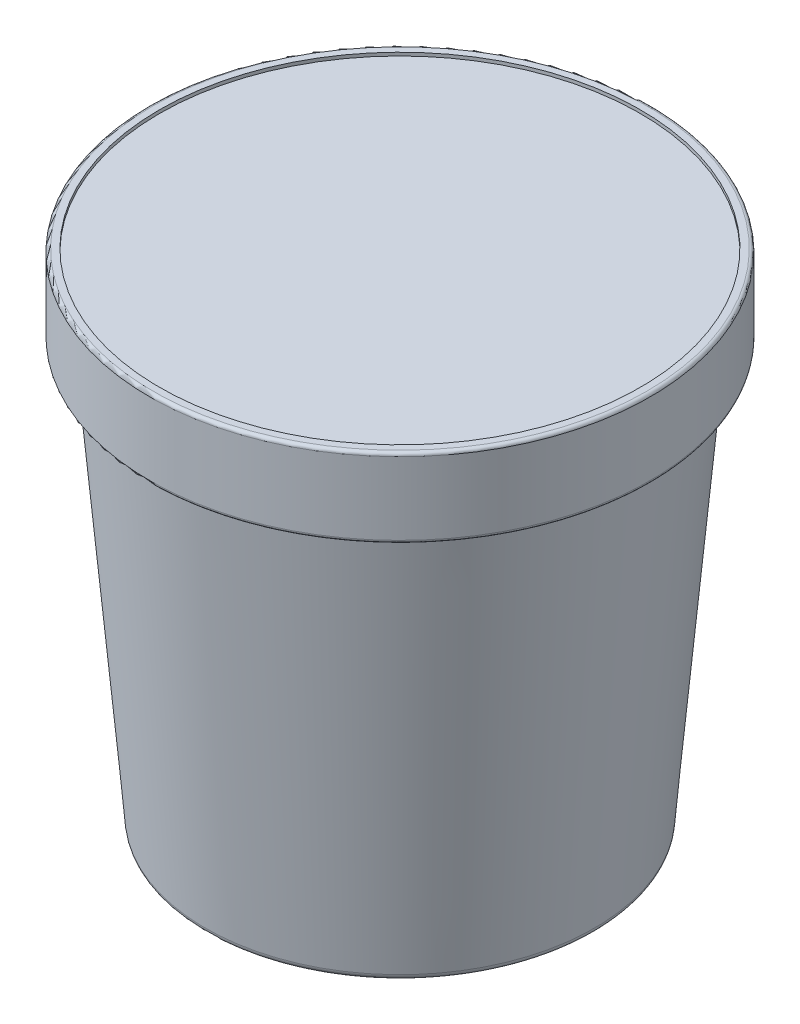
from build123d import *


with BuildPart() as part:
    # Sketch1 → Revolve1 (revolve)
    with BuildSketch(Plane.XY, mode=Mode.PRIVATE) as revolve1_sk:
        with BuildLine():
            Line((38, 75), (38, 64))
            ThreePointArc((38, 64), (37.853553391, 63.646446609), (37.5, 63.5))
            Line((37.5, 63.5), (35, 63.5))
            Line((35, 63.5), (29.52433339, 0.912844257))
            ThreePointArc((29.52433339, 0.912844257), (29.2037289, 0.262722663), (28.528138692, 0))
            Line((28.528138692, 0), (0, 0))
            Line((0, 0), (0, 75))
            Line((0, 75), (36.5, 75))
            Line((36.5, 75), (36.5, 75.5))
            Line((36.5, 75.5), (37.5, 75.5))
            ThreePointArc((37.5, 75.5), (37.853553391, 75.353553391), (38, 75))
        make_face()
    revolve(revolve1_sk.sketch.rotate(Axis((0, 75, 0), (0, -1, 0)), 180), axis=Axis((0, 75, 0), (0, -1, 0)))


solid = part.part
